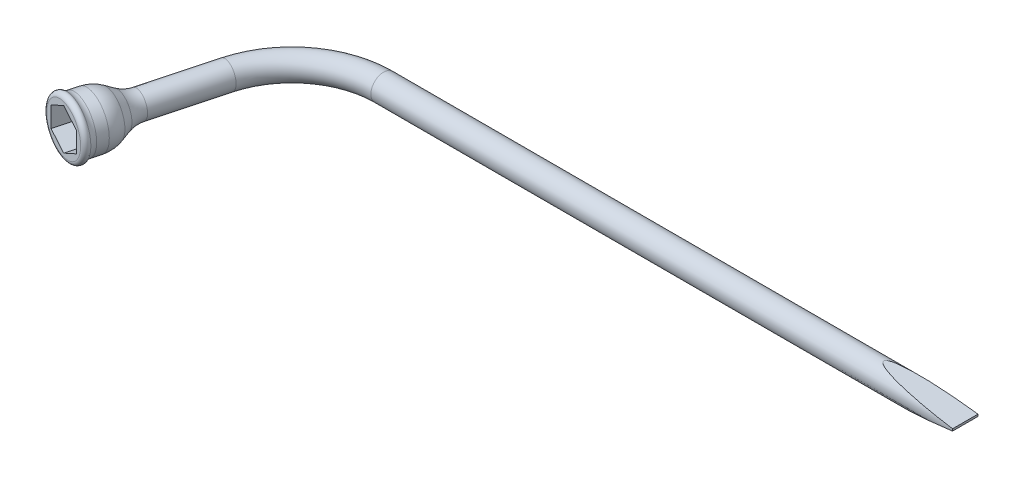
ISO-10303-21;
HEADER;
FILE_DESCRIPTION(('STEP AP214'),'2;1');
FILE_NAME('part.step','',(''),(''),'','','');
FILE_SCHEMA(('AUTOMOTIVE_DESIGN { 1 0 10303 214 1 1 1 1 }'));
ENDSEC;
DATA;
#1=APPLICATION_CONTEXT('core data for automotive mechanical design processes');
#2=APPLICATION_PROTOCOL_DEFINITION('international standard','automotive_design',2000,#1);
#3=PRODUCT_CONTEXT('',#1,'mechanical');
#4=PRODUCT('Part','Part','',(#3));
#5=PRODUCT_RELATED_PRODUCT_CATEGORY('part','',(#4));
#6=PRODUCT_DEFINITION_FORMATION('','',#4);
#7=PRODUCT_DEFINITION_CONTEXT('part definition',#1,'design');
#8=PRODUCT_DEFINITION('design','',#6,#7);
#9=PRODUCT_DEFINITION_SHAPE('','',#8);
#10=(LENGTH_UNIT() NAMED_UNIT(*) SI_UNIT(.MILLI.,.METRE.));
#11=(NAMED_UNIT(*) PLANE_ANGLE_UNIT() SI_UNIT($,.RADIAN.));
#12=(NAMED_UNIT(*) SI_UNIT($,.STERADIAN.) SOLID_ANGLE_UNIT());
#13=UNCERTAINTY_MEASURE_WITH_UNIT(LENGTH_MEASURE(1.E-05),#10,'distance_accuracy_value','');
#14=(GEOMETRIC_REPRESENTATION_CONTEXT(3) GLOBAL_UNCERTAINTY_ASSIGNED_CONTEXT((#13)) GLOBAL_UNIT_ASSIGNED_CONTEXT((#10,
#11,#12)) REPRESENTATION_CONTEXT('',''));
#15=CARTESIAN_POINT('',(0.,0.,0.));
#16=DIRECTION('',(0.,0.,1.));
#17=DIRECTION('',(1.,0.,0.));
#18=AXIS2_PLACEMENT_3D('',#15,#16,#17);
#19=CARTESIAN_POINT('',(43.8527373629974,0.,0.));
#20=DIRECTION('',(1.,0.,0.));
#21=DIRECTION('',(0.,0.,-1.));
#22=AXIS2_PLACEMENT_3D('',#19,#20,#21);
#23=CYLINDRICAL_SURFACE('',#22,7.9375);
#24=CARTESIAN_POINT('',(43.8527373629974,0.,0.));
#25=DIRECTION('',(1.,0.,0.));
#26=DIRECTION('',(0.,0.,-1.));
#27=AXIS2_PLACEMENT_3D('',#24,#25,#26);
#28=CIRCLE('',#27,7.9375);
#29=CARTESIAN_POINT('',(43.8527373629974,0.,-7.93749999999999));
#30=VERTEX_POINT('',#29);
#31=EDGE_CURVE('E107',#30,#30,#28,.T.);
#32=ORIENTED_EDGE('',*,*,#31,.T.);
#33=EDGE_LOOP('',(#32));
#34=FACE_BOUND('',#33,.T.);
#35=CARTESIAN_POINT('',(406.4,0.,0.));
#36=DIRECTION('',(1.,0.,0.));
#37=DIRECTION('',(0.,0.,-1.));
#38=AXIS2_PLACEMENT_3D('',#35,#36,#37);
#39=CIRCLE('',#38,7.9375);
#40=CARTESIAN_POINT('',(406.4,0.634999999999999,7.91205922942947));
#41=VERTEX_POINT('',#40);
#42=CARTESIAN_POINT('',(406.4,-0.635000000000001,7.9120592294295));
#43=VERTEX_POINT('',#42);
#44=EDGE_CURVE('E94',#41,#43,#39,.T.);
#45=ORIENTED_EDGE('',*,*,#44,.F.);
#46=CARTESIAN_POINT('',(410.817391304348,0.,0.));
#47=DIRECTION('',(0.1422873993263,0.98982538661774,0.));
#48=DIRECTION('',(0.98982538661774,-0.1422873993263,0.));
#49=AXIS2_PLACEMENT_3D('',#46,#47,#48);
#50=ELLIPSE('',#49,55.7849819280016,7.9375);
#51=CARTESIAN_POINT('',(406.4,0.634999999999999,-7.9120592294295));
#52=VERTEX_POINT('',#51);
#53=EDGE_CURVE('E99',#41,#52,#50,.F.);
#54=ORIENTED_EDGE('',*,*,#53,.T.);
#55=CARTESIAN_POINT('',(406.4,-0.635000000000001,-7.91205922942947));
#56=VERTEX_POINT('',#55);
#57=EDGE_CURVE('E44',#56,#52,#39,.T.);
#58=ORIENTED_EDGE('',*,*,#57,.F.);
#59=CARTESIAN_POINT('',(410.817391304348,0.,0.));
#60=DIRECTION('',(0.1422873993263,-0.98982538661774,0.));
#61=DIRECTION('',(0.98982538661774,0.1422873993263,0.));
#62=AXIS2_PLACEMENT_3D('',#59,#60,#61);
#63=ELLIPSE('',#62,55.7849819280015,7.9375);
#64=EDGE_CURVE('E93',#56,#43,#63,.F.);
#65=ORIENTED_EDGE('',*,*,#64,.T.);
#66=EDGE_LOOP('',(#45,#54,#58,#65));
#67=FACE_BOUND('',#66,.T.);
#68=ADVANCED_FACE('F28',(#34,#67),#23,.T.);
#69=CARTESIAN_POINT('',(406.4,0.,0.));
#70=DIRECTION('',(1.,0.,0.));
#71=DIRECTION('',(0.,0.,-1.));
#72=AXIS2_PLACEMENT_3D('',#69,#70,#71);
#73=PLANE('',#72);
#74=DIRECTION('',(0.,0.,-1.));
#75=VECTOR('',#74,1.);
#76=CARTESIAN_POINT('',(406.4,-0.635000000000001,0.));
#77=LINE('',#76,#75);
#78=EDGE_CURVE('E32',#43,#56,#77,.T.);
#79=ORIENTED_EDGE('',*,*,#78,.T.);
#80=ORIENTED_EDGE('',*,*,#57,.T.);
#81=DIRECTION('',(0.,0.,-1.));
#82=VECTOR('',#81,1.);
#83=CARTESIAN_POINT('',(406.4,0.634999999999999,700.152256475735));
#84=LINE('',#83,#82);
#85=EDGE_CURVE('E11',#41,#52,#84,.T.);
#86=ORIENTED_EDGE('',*,*,#85,.F.);
#87=ORIENTED_EDGE('',*,*,#44,.T.);
#88=EDGE_LOOP('',(#79,#80,#86,#87));
#89=FACE_BOUND('',#88,.T.);
#90=ADVANCED_FACE('F101',(#89),#73,.T.);
#91=CARTESIAN_POINT('',(-11.3499236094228,0.,42.3584915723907));
#92=DIRECTION('',(-0.258819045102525,0.,0.965925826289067));
#93=DIRECTION('',(0.965925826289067,0.,0.258819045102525));
#94=AXIS2_PLACEMENT_3D('',#91,#92,#93);
#95=CYLINDRICAL_SURFACE('',#94,7.9375);
#96=CARTESIAN_POINT('',(-23.0090131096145,0.,85.8708059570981));
#97=DIRECTION('',(0.258819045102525,0.,-0.965925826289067));
#98=DIRECTION('',(-0.965925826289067,0.,-0.258819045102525));
#99=AXIS2_PLACEMENT_3D('',#96,#97,#98);
#100=CIRCLE('',#99,7.9375);
#101=CARTESIAN_POINT('',(-30.6760493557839,0.,83.8164297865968));
#102=VERTEX_POINT('',#101);
#103=EDGE_CURVE('E130',#102,#102,#100,.T.);
#104=ORIENTED_EDGE('',*,*,#103,.T.);
#105=EDGE_LOOP('',(#104));
#106=FACE_BOUND('',#105,.T.);
#107=CARTESIAN_POINT('',(-11.3499236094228,0.,42.3584915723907));
#108=DIRECTION('',(0.258819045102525,0.,-0.965925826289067));
#109=DIRECTION('',(-0.965925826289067,0.,-0.258819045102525));
#110=AXIS2_PLACEMENT_3D('',#107,#108,#109);
#111=CIRCLE('',#110,7.9375);
#112=CARTESIAN_POINT('',(-19.0169598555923,0.,40.3041154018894));
#113=VERTEX_POINT('',#112);
#114=EDGE_CURVE('E105',#113,#113,#111,.T.);
#115=ORIENTED_EDGE('',*,*,#114,.F.);
#116=EDGE_LOOP('',(#115));
#117=FACE_BOUND('',#116,.T.);
#118=ADVANCED_FACE('F30',(#106,#117),#95,.T.);
#119=CARTESIAN_POINT('',(43.8527373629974,0.,57.15));
#120=DIRECTION('',(0.,1.,0.));
#121=DIRECTION('',(0.,0.,1.));
#122=AXIS2_PLACEMENT_3D('',#119,#120,#121);
#123=TOROIDAL_SURFACE('',#122,57.15,7.9375);
#124=CARTESIAN_POINT('',(43.8527373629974,0.,57.15));
#125=DIRECTION('',(0.,1.,0.));
#126=DIRECTION('',(0.,0.,1.));
#127=AXIS2_PLACEMENT_3D('',#124,#125,#126);
#128=CIRCLE('',#127,65.0875);
#129=EDGE_CURVE('',#30,#113,#128,.T.);
#130=ORIENTED_EDGE('',*,*,#31,.F.);
#131=ORIENTED_EDGE('',*,*,#114,.T.);
#132=ORIENTED_EDGE('',*,*,#129,.T.);
#133=ORIENTED_EDGE('',*,*,#129,.F.);
#134=EDGE_LOOP('',(#130,#132,#131,#133));
#135=FACE_BOUND('',#134,.T.);
#136=ADVANCED_FACE('F246',(#135),#123,.T.);
#137=CARTESIAN_POINT('',(-32.2126183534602,0.,120.219128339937));
#138=DIRECTION('',(0.258819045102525,0.,-0.965925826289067));
#139=DIRECTION('',(-0.965925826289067,0.,-0.258819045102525));
#140=AXIS2_PLACEMENT_3D('',#137,#138,#139);
#141=TOROIDAL_SURFACE('',#140,14.9225,2.54);
#142=CARTESIAN_POINT('',(-32.8700187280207,0.,122.672579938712));
#143=DIRECTION('',(0.258819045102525,0.,-0.965925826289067));
#144=DIRECTION('',(-0.965925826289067,0.,-0.258819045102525));
#145=AXIS2_PLACEMENT_3D('',#142,#143,#144);
#146=CIRCLE('',#145,14.9225);
#147=CARTESIAN_POINT('',(-47.2840468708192,0.,118.810352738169));
#148=VERTEX_POINT('',#147);
#149=EDGE_CURVE('E102',#148,#148,#146,.T.);
#150=ORIENTED_EDGE('',*,*,#149,.T.);
#151=EDGE_LOOP('',(#150));
#152=FACE_BOUND('',#151,.T.);
#153=CARTESIAN_POINT('',(-31.8376954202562,0.,118.819896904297));
#154=DIRECTION('',(0.258819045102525,0.,-0.965925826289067));
#155=DIRECTION('',(-0.965925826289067,0.,-0.258819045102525));
#156=AXIS2_PLACEMENT_3D('',#153,#154,#155);
#157=CIRCLE('',#156,17.0089285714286);
#158=CARTESIAN_POINT('',(-48.267058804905,0.,114.417662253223));
#159=VERTEX_POINT('',#158);
#160=EDGE_CURVE('E115',#159,#159,#157,.T.);
#161=ORIENTED_EDGE('',*,*,#160,.F.);
#162=EDGE_LOOP('',(#161));
#163=FACE_BOUND('',#162,.T.);
#164=ADVANCED_FACE('F248',(#152,#163),#141,.T.);
#165=CARTESIAN_POINT('',(-30.900388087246,0.,115.321818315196));
#166=DIRECTION('',(0.258819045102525,0.,-0.965925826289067));
#167=DIRECTION('',(-0.965925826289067,0.,-0.258819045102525));
#168=AXIS2_PLACEMENT_3D('',#165,#166,#167);
#169=TOROIDAL_SURFACE('',#168,22.225,6.35000000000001);
#170=ORIENTED_EDGE('',*,*,#160,.T.);
#171=EDGE_LOOP('',(#170));
#172=FACE_BOUND('',#171,.T.);
#173=CARTESIAN_POINT('',(-30.900388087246,0.,115.321818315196));
#174=DIRECTION('',(0.258819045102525,0.,-0.965925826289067));
#175=DIRECTION('',(-0.965925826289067,0.,-0.258819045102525));
#176=AXIS2_PLACEMENT_3D('',#173,#174,#175);
#177=CIRCLE('',#176,15.875);
#178=CARTESIAN_POINT('',(-46.2344605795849,0.,111.213065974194));
#179=VERTEX_POINT('',#178);
#180=EDGE_CURVE('E118',#179,#179,#177,.T.);
#181=ORIENTED_EDGE('',*,*,#180,.F.);
#182=EDGE_LOOP('',(#181));
#183=FACE_BOUND('',#182,.T.);
#184=ADVANCED_FACE('F254',(#172,#183),#169,.F.);
#185=CARTESIAN_POINT('',(-15.1267657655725,0.,56.4538583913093));
#186=DIRECTION('',(0.258819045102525,0.,-0.965925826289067));
#187=DIRECTION('',(-0.965925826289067,0.,-0.258819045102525));
#188=AXIS2_PLACEMENT_3D('',#185,#186,#187);
#189=CYLINDRICAL_SURFACE('',#188,15.875);
#190=CARTESIAN_POINT('',(-29.2370166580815,0.,109.114031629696));
#191=DIRECTION('',(0.258819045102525,0.,-0.965925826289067));
#192=DIRECTION('',(-0.965925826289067,0.,-0.258819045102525));
#193=AXIS2_PLACEMENT_3D('',#190,#191,#192);
#194=CIRCLE('',#193,15.875);
#195=CARTESIAN_POINT('',(-44.5710891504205,0.,105.005279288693));
#196=VERTEX_POINT('',#195);
#197=EDGE_CURVE('E121',#196,#196,#194,.T.);
#198=CARTESIAN_POINT('',(-46.2344605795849,0.,111.213065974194));
#199=CARTESIAN_POINT('',(-46.2171337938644,0.,111.148401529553));
#200=CARTESIAN_POINT('',(-46.199807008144,0.,111.083737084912));
#201=CARTESIAN_POINT('',(-46.165153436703,0.,110.954408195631));
#202=CARTESIAN_POINT('',(-46.1478266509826,0.,110.88974375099));
#203=CARTESIAN_POINT('',(-46.1131730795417,0.,110.760414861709));
#204=CARTESIAN_POINT('',(-46.0958462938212,0.,110.695750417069));
#205=CARTESIAN_POINT('',(-46.0611927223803,0.,110.566421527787));
#206=CARTESIAN_POINT('',(-46.0438659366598,0.,110.501757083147));
#207=CARTESIAN_POINT('',(-46.0092123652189,0.,110.372428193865));
#208=CARTESIAN_POINT('',(-45.9918855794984,0.,110.307763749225));
#209=CARTESIAN_POINT('',(-45.9572320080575,0.,110.178434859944));
#210=CARTESIAN_POINT('',(-45.939905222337,0.,110.113770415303));
#211=CARTESIAN_POINT('',(-45.9052516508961,0.,109.984441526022));
#212=CARTESIAN_POINT('',(-45.8879248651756,0.,109.919777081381));
#213=CARTESIAN_POINT('',(-45.8532712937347,0.,109.7904481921));
#214=CARTESIAN_POINT('',(-45.8359445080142,0.,109.725783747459));
#215=CARTESIAN_POINT('',(-45.8012909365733,0.,109.596454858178));
#216=CARTESIAN_POINT('',(-45.7839641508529,0.,109.531790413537));
#217=CARTESIAN_POINT('',(-45.7493105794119,0.,109.402461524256));
#218=CARTESIAN_POINT('',(-45.7319837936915,0.,109.337797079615));
#219=CARTESIAN_POINT('',(-45.6973302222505,0.,109.208468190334));
#220=CARTESIAN_POINT('',(-45.6800034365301,0.,109.143803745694));
#221=CARTESIAN_POINT('',(-45.6453498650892,0.,109.014474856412));
#222=CARTESIAN_POINT('',(-45.6280230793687,0.,108.949810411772));
#223=CARTESIAN_POINT('',(-45.5933695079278,0.,108.82048152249));
#224=CARTESIAN_POINT('',(-45.5760427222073,0.,108.75581707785));
#225=CARTESIAN_POINT('',(-45.5413891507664,0.,108.626488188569));
#226=CARTESIAN_POINT('',(-45.5240623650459,0.,108.561823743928));
#227=CARTESIAN_POINT('',(-45.489408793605,0.,108.432494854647));
#228=CARTESIAN_POINT('',(-45.4720820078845,0.,108.367830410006));
#229=CARTESIAN_POINT('',(-45.4374284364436,0.,108.238501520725));
#230=CARTESIAN_POINT('',(-45.4201016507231,0.,108.173837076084));
#231=CARTESIAN_POINT('',(-45.3854480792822,0.,108.044508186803));
#232=CARTESIAN_POINT('',(-45.3681212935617,0.,107.979843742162));
#233=CARTESIAN_POINT('',(-45.3334677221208,0.,107.850514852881));
#234=CARTESIAN_POINT('',(-45.3161409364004,0.,107.78585040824));
#235=CARTESIAN_POINT('',(-45.2814873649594,0.,107.656521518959));
#236=CARTESIAN_POINT('',(-45.264160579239,0.,107.591857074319));
#237=CARTESIAN_POINT('',(-45.229507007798,0.,107.462528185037));
#238=CARTESIAN_POINT('',(-45.2121802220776,0.,107.397863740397));
#239=CARTESIAN_POINT('',(-45.1775266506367,0.,107.268534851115));
#240=CARTESIAN_POINT('',(-45.1601998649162,0.,107.203870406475));
#241=CARTESIAN_POINT('',(-45.1255462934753,0.,107.074541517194));
#242=CARTESIAN_POINT('',(-45.1082195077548,0.,107.009877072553));
#243=CARTESIAN_POINT('',(-45.0735659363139,0.,106.880548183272));
#244=CARTESIAN_POINT('',(-45.0562391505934,0.,106.815883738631));
#245=CARTESIAN_POINT('',(-45.0215855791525,0.,106.68655484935));
#246=CARTESIAN_POINT('',(-45.004258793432,0.,106.621890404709));
#247=CARTESIAN_POINT('',(-44.9696052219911,0.,106.492561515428));
#248=CARTESIAN_POINT('',(-44.9522784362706,0.,106.427897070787));
#249=CARTESIAN_POINT('',(-44.9176248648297,0.,106.298568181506));
#250=CARTESIAN_POINT('',(-44.9002980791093,0.,106.233903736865));
#251=CARTESIAN_POINT('',(-44.8656445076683,0.,106.104574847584));
#252=CARTESIAN_POINT('',(-44.8483177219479,0.,106.039910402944));
#253=CARTESIAN_POINT('',(-44.8136641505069,0.,105.910581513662));
#254=CARTESIAN_POINT('',(-44.7963373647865,0.,105.845917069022));
#255=CARTESIAN_POINT('',(-44.7616837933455,0.,105.71658817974));
#256=CARTESIAN_POINT('',(-44.7443570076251,0.,105.6519237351));
#257=CARTESIAN_POINT('',(-44.7097034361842,0.,105.522594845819));
#258=CARTESIAN_POINT('',(-44.6923766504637,0.,105.457930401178));
#259=CARTESIAN_POINT('',(-44.6577230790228,0.,105.328601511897));
#260=CARTESIAN_POINT('',(-44.6403962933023,0.,105.263937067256));
#261=CARTESIAN_POINT('',(-44.6057427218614,0.,105.134608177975));
#262=CARTESIAN_POINT('',(-44.5884159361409,0.,105.069943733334));
#263=CARTESIAN_POINT('',(-44.5710891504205,0.,105.005279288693));
#264=B_SPLINE_CURVE_WITH_KNOTS('',3,(#198,#199,#200,#201,#202,#203,#204,#205,#206,#207,#208,
#209,#210,#211,#212,#213,#214,#215,#216,#217,#218,#219,#220,#221,#222,#223,#224,#225,#226,#227,
#228,#229,#230,#231,#232,#233,#234,#235,#236,#237,#238,#239,#240,#241,#242,#243,#244,#245,#246,
#247,#248,#249,#250,#251,#252,#253,#254,#255,#256,#257,#258,#259,#260,#261,#262,#263),
.UNSPECIFIED.,.F.,.F.,(4,2,2,2,2,2,2,2,2,2,2,2,2,2,2,2,2,2,2,2,2,2,2,2,2,2,2,2,2,2,2,2,4),(0.,
0.20083667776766,0.401673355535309,0.60251003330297,0.803346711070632,1.00418338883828,
1.20502006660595,1.4058567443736,1.60669342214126,1.80753009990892,2.00836677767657,
2.20920345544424,2.4100401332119,2.61087681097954,2.8117134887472,3.01255016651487,
3.21338684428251,3.41422352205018,3.61506019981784,3.81589687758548,4.01673355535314,
4.21757023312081,4.41840691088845,4.61924358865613,4.82008026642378,5.02091694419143,
5.2217536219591,5.42259029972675,5.62342697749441,5.82426365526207,6.02510033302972,
6.22593701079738,6.42677368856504),.UNSPECIFIED.);
#265=EDGE_CURVE('BSEAM283',#179,#196,#264,.T.);
#266=ORIENTED_EDGE('',*,*,#180,.T.);
#267=ORIENTED_EDGE('',*,*,#197,.F.);
#268=ORIENTED_EDGE('',*,*,#265,.T.);
#269=ORIENTED_EDGE('',*,*,#265,.F.);
#270=EDGE_LOOP('',(#266,#268,#267,#269));
#271=FACE_BOUND('',#270,.T.);
#272=ADVANCED_FACE('F283',(#271),#189,.T.);
#273=CARTESIAN_POINT('',(-29.2370166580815,0.,109.114031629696));
#274=DIRECTION('',(0.258819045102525,0.,-0.965925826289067));
#275=DIRECTION('',(-0.965925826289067,0.,-0.258819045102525));
#276=AXIS2_PLACEMENT_3D('',#273,#274,#275);
#277=DEGENERATE_TOROIDAL_SURFACE('',#276,3.17500000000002,19.05,.F.);
#278=ORIENTED_EDGE('',*,*,#197,.T.);
#279=EDGE_LOOP('',(#278));
#280=FACE_BOUND('',#279,.T.);
#281=CARTESIAN_POINT('',(-26.8100852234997,0.,100.056600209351));
#282=DIRECTION('',(0.258819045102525,0.,-0.965925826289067));
#283=DIRECTION('',(-0.965925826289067,0.,-0.258819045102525));
#284=AXIS2_PLACEMENT_3D('',#281,#282,#283);
#285=CIRCLE('',#284,13.4073834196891);
#286=CARTESIAN_POINT('',(-13.8595473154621,0.,103.526686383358));
#287=VERTEX_POINT('',#286);
#288=EDGE_CURVE('E124',#287,#287,#285,.T.);
#289=ORIENTED_EDGE('',*,*,#288,.F.);
#290=EDGE_LOOP('',(#289));
#291=FACE_BOUND('',#290,.T.);
#292=ADVANCED_FACE('F275',(#280,#291),#277,.F.);
#293=CARTESIAN_POINT('',(-25.4359445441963,0.,94.9282373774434));
#294=DIRECTION('',(-0.258819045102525,0.,0.965925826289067));
#295=DIRECTION('',(0.965925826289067,0.,0.258819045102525));
#296=AXIS2_PLACEMENT_3D('',#293,#294,#295);
#297=CONICAL_SURFACE('',#296,10.4051165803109,0.51464742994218);
#298=CARTESIAN_POINT('',(-25.4359445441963,0.,94.9282373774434));
#299=DIRECTION('',(0.258819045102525,0.,-0.965925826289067));
#300=DIRECTION('',(-0.965925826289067,0.,-0.258819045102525));
#301=AXIS2_PLACEMENT_3D('',#298,#299,#300);
#302=CIRCLE('',#301,10.4051165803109);
#303=CARTESIAN_POINT('',(-15.3853737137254,0.,97.6212797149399));
#304=VERTEX_POINT('',#303);
#305=EDGE_CURVE('E127',#304,#304,#302,.T.);
#306=CARTESIAN_POINT('',(-13.8595473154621,0.,103.526686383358));
#307=CARTESIAN_POINT('',(-13.875441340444,0.,103.465171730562));
#308=CARTESIAN_POINT('',(-13.8913353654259,0.,103.403657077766));
#309=CARTESIAN_POINT('',(-13.9231234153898,0.,103.280627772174));
#310=CARTESIAN_POINT('',(-13.9390174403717,0.,103.219113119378));
#311=CARTESIAN_POINT('',(-13.9708054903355,0.,103.096083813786));
#312=CARTESIAN_POINT('',(-13.9866995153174,0.,103.03456916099));
#313=CARTESIAN_POINT('',(-14.0184875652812,0.,102.911539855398));
#314=CARTESIAN_POINT('',(-14.0343815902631,0.,102.850025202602));
#315=CARTESIAN_POINT('',(-14.0661696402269,0.,102.72699589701));
#316=CARTESIAN_POINT('',(-14.0820636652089,0.,102.665481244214));
#317=CARTESIAN_POINT('',(-14.1138517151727,0.,102.542451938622));
#318=CARTESIAN_POINT('',(-14.1297457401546,0.,102.480937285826));
#319=CARTESIAN_POINT('',(-14.1615337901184,0.,102.357907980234));
#320=CARTESIAN_POINT('',(-14.1774278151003,0.,102.296393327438));
#321=CARTESIAN_POINT('',(-14.2092158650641,0.,102.173364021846));
#322=CARTESIAN_POINT('',(-14.225109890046,0.,102.11184936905));
#323=CARTESIAN_POINT('',(-14.2568979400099,0.,101.988820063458));
#324=CARTESIAN_POINT('',(-14.2727919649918,0.,101.927305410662));
#325=CARTESIAN_POINT('',(-14.3045800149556,0.,101.804276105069));
#326=CARTESIAN_POINT('',(-14.3204740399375,0.,101.742761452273));
#327=CARTESIAN_POINT('',(-14.3522620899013,0.,101.619732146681));
#328=CARTESIAN_POINT('',(-14.3681561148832,0.,101.558217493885));
#329=CARTESIAN_POINT('',(-14.399944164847,0.,101.435188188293));
#330=CARTESIAN_POINT('',(-14.415838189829,0.,101.373673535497));
#331=CARTESIAN_POINT('',(-14.4476262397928,0.,101.250644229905));
#332=CARTESIAN_POINT('',(-14.4635202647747,0.,101.189129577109));
#333=CARTESIAN_POINT('',(-14.4953083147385,0.,101.066100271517));
#334=CARTESIAN_POINT('',(-14.5112023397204,0.,101.004585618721));
#335=CARTESIAN_POINT('',(-14.5429903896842,0.,100.881556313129));
#336=CARTESIAN_POINT('',(-14.5588844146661,0.,100.820041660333));
#337=CARTESIAN_POINT('',(-14.59067246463,0.,100.697012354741));
#338=CARTESIAN_POINT('',(-14.6065664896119,0.,100.635497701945));
#339=CARTESIAN_POINT('',(-14.6383545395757,0.,100.512468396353));
#340=CARTESIAN_POINT('',(-14.6542485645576,0.,100.450953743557));
#341=CARTESIAN_POINT('',(-14.6860366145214,0.,100.327924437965));
#342=CARTESIAN_POINT('',(-14.7019306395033,0.,100.266409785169));
#343=CARTESIAN_POINT('',(-14.7337186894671,0.,100.143380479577));
#344=CARTESIAN_POINT('',(-14.7496127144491,0.,100.081865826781));
#345=CARTESIAN_POINT('',(-14.7814007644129,0.,99.9588365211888));
#346=CARTESIAN_POINT('',(-14.7972947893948,0.,99.8973218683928));
#347=CARTESIAN_POINT('',(-14.8290828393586,0.,99.7742925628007));
#348=CARTESIAN_POINT('',(-14.8449768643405,0.,99.7127779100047));
#349=CARTESIAN_POINT('',(-14.8767649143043,0.,99.5897486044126));
#350=CARTESIAN_POINT('',(-14.8926589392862,0.,99.5282339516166));
#351=CARTESIAN_POINT('',(-14.9244469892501,0.,99.4052046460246));
#352=CARTESIAN_POINT('',(-14.940341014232,0.,99.3436899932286));
#353=CARTESIAN_POINT('',(-14.9721290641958,0.,99.2206606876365));
#354=CARTESIAN_POINT('',(-14.9880230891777,0.,99.1591460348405));
#355=CARTESIAN_POINT('',(-15.0198111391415,0.,99.0361167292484));
#356=CARTESIAN_POINT('',(-15.0357051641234,0.,98.9746020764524));
#357=CARTESIAN_POINT('',(-15.0674932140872,0.,98.8515727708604));
#358=CARTESIAN_POINT('',(-15.0833872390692,0.,98.7900581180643));
#359=CARTESIAN_POINT('',(-15.115175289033,0.,98.6670288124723));
#360=CARTESIAN_POINT('',(-15.1310693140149,0.,98.6055141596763));
#361=CARTESIAN_POINT('',(-15.1628573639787,0.,98.4824848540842));
#362=CARTESIAN_POINT('',(-15.1787513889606,0.,98.4209702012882));
#363=CARTESIAN_POINT('',(-15.2105394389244,0.,98.2979408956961));
#364=CARTESIAN_POINT('',(-15.2264334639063,0.,98.2364262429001));
#365=CARTESIAN_POINT('',(-15.2582215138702,0.,98.1133969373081));
#366=CARTESIAN_POINT('',(-15.2741155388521,0.,98.051882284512));
#367=CARTESIAN_POINT('',(-15.3059035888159,0.,97.92885297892));
#368=CARTESIAN_POINT('',(-15.3217976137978,0.,97.867338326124));
#369=CARTESIAN_POINT('',(-15.3535856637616,0.,97.7443090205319));
#370=CARTESIAN_POINT('',(-15.3694796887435,0.,97.6827943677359));
#371=CARTESIAN_POINT('',(-15.3853737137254,0.,97.6212797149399));
#372=B_SPLINE_CURVE_WITH_KNOTS('',3,(#306,#307,#308,#309,#310,#311,#312,#313,#314,#315,#316,
#317,#318,#319,#320,#321,#322,#323,#324,#325,#326,#327,#328,#329,#330,#331,#332,#333,#334,#335,
#336,#337,#338,#339,#340,#341,#342,#343,#344,#345,#346,#347,#348,#349,#350,#351,#352,#353,#354,
#355,#356,#357,#358,#359,#360,#361,#362,#363,#364,#365,#366,#367,#368,#369,#370,#371),
.UNSPECIFIED.,.F.,.F.,(4,2,2,2,2,2,2,2,2,2,2,2,2,2,2,2,2,2,2,2,2,2,2,2,2,2,2,2,2,2,2,2,4),(0.,
0.190604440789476,0.381208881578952,0.571813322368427,0.762417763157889,0.953022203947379,
1.14362664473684,1.33423108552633,1.52483552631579,1.71543996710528,1.90604440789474,
2.09664884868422,2.28725328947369,2.47785773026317,2.66846217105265,2.85906661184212,
3.0496710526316,3.24027549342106,3.43087993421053,3.62148437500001,3.81208881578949,
4.00269325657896,4.19329769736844,4.3839021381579,4.57450657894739,4.76511101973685,
4.95571546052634,5.1463199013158,5.33692434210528,5.52752878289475,5.71813322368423,
5.90873766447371,6.09934210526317),.UNSPECIFIED.);
#373=EDGE_CURVE('BSEAM266',#287,#304,#372,.T.);
#374=ORIENTED_EDGE('',*,*,#288,.T.);
#375=ORIENTED_EDGE('',*,*,#305,.F.);
#376=ORIENTED_EDGE('',*,*,#373,.T.);
#377=ORIENTED_EDGE('',*,*,#373,.F.);
#378=EDGE_LOOP('',(#374,#376,#375,#377));
#379=FACE_BOUND('',#378,.T.);
#380=ADVANCED_FACE('F266',(#379),#297,.T.);
#381=CARTESIAN_POINT('',(-23.0090131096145,0.,85.8708059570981));
#382=DIRECTION('',(0.258819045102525,0.,-0.965925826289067));
#383=DIRECTION('',(-0.965925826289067,0.,-0.258819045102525));
#384=AXIS2_PLACEMENT_3D('',#381,#382,#383);
#385=TOROIDAL_SURFACE('',#384,26.9875,19.05);
#386=ORIENTED_EDGE('',*,*,#305,.T.);
#387=EDGE_LOOP('',(#386));
#388=FACE_BOUND('',#387,.T.);
#389=ORIENTED_EDGE('',*,*,#103,.F.);
#390=EDGE_LOOP('',(#389));
#391=FACE_BOUND('',#390,.T.);
#392=ADVANCED_FACE('F264',(#388,#391),#385,.F.);
#393=CARTESIAN_POINT('',(-32.8700187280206,0.,122.672579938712));
#394=DIRECTION('',(0.258819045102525,0.,-0.965925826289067));
#395=DIRECTION('',(-0.965925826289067,0.,-0.258819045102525));
#396=AXIS2_PLACEMENT_3D('',#393,#394,#395);
#397=PLANE('',#396);
#398=DIRECTION('',(0.,1.,0.));
#399=VECTOR('',#398,1.);
#400=CARTESIAN_POINT('',(-22.1361679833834,-6.41580486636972,125.548706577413));
#401=LINE('',#400,#399);
#402=CARTESIAN_POINT('',(-22.1361679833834,-6.41580486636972,125.548706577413));
#403=VERTEX_POINT('',#402);
#404=CARTESIAN_POINT('',(-22.1361679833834,6.41580486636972,125.548706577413));
#405=VERTEX_POINT('',#404);
#406=EDGE_CURVE('E175',#403,#405,#401,.T.);
#407=ORIENTED_EDGE('',*,*,#406,.F.);
#408=DIRECTION('',(0.836516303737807,0.5,0.224143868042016));
#409=VECTOR('',#408,1.);
#410=CARTESIAN_POINT('',(-32.8700187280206,-12.8316097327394,122.672579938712));
#411=LINE('',#410,#409);
#412=CARTESIAN_POINT('',(-32.8700187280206,-12.8316097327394,122.672579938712));
#413=VERTEX_POINT('',#412);
#414=EDGE_CURVE('E178',#413,#403,#411,.T.);
#415=ORIENTED_EDGE('',*,*,#414,.F.);
#416=DIRECTION('',(0.836516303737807,-0.5,0.224143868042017));
#417=VECTOR('',#416,1.);
#418=CARTESIAN_POINT('',(-43.6038694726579,-6.41580486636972,119.79645330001));
#419=LINE('',#418,#417);
#420=CARTESIAN_POINT('',(-43.6038694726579,-6.41580486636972,119.79645330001));
#421=VERTEX_POINT('',#420);
#422=EDGE_CURVE('E163',#421,#413,#419,.T.);
#423=ORIENTED_EDGE('',*,*,#422,.F.);
#424=DIRECTION('',(0.,-1.,0.));
#425=VECTOR('',#424,1.);
#426=CARTESIAN_POINT('',(-43.6038694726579,6.41580486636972,119.79645330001));
#427=LINE('',#426,#425);
#428=CARTESIAN_POINT('',(-43.6038694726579,6.41580486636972,119.79645330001));
#429=VERTEX_POINT('',#428);
#430=EDGE_CURVE('E166',#429,#421,#427,.T.);
#431=ORIENTED_EDGE('',*,*,#430,.F.);
#432=DIRECTION('',(-0.836516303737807,-0.5,-0.224143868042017));
#433=VECTOR('',#432,1.);
#434=CARTESIAN_POINT('',(-32.8700187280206,12.8316097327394,122.672579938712));
#435=LINE('',#434,#433);
#436=CARTESIAN_POINT('',(-32.8700187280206,12.8316097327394,122.672579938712));
#437=VERTEX_POINT('',#436);
#438=EDGE_CURVE('E169',#437,#429,#435,.T.);
#439=ORIENTED_EDGE('',*,*,#438,.F.);
#440=DIRECTION('',(-0.836516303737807,0.5,-0.224143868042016));
#441=VECTOR('',#440,1.);
#442=CARTESIAN_POINT('',(-22.1361679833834,6.41580486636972,125.548706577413));
#443=LINE('',#442,#441);
#444=EDGE_CURVE('E172',#405,#437,#443,.T.);
#445=ORIENTED_EDGE('',*,*,#444,.F.);
#446=EDGE_LOOP('',(#407,#415,#423,#431,#439,#445));
#447=FACE_BOUND('',#446,.T.);
#448=ORIENTED_EDGE('',*,*,#149,.F.);
#449=EDGE_LOOP('',(#448));
#450=FACE_BOUND('',#449,.T.);
#451=ADVANCED_FACE('F245',(#447,#450),#397,.F.);
#452=CARTESIAN_POINT('',(-29.5830168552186,-12.8316097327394,110.40532194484));
#453=DIRECTION('',(0.482962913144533,-0.866025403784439,0.129409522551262));
#454=DIRECTION('',(0.873369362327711,0.487058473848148,0.));
#455=AXIS2_PLACEMENT_3D('',#452,#453,#454);
#456=PLANE('',#455);
#457=ORIENTED_EDGE('',*,*,#414,.T.);
#458=DIRECTION('',(-0.258819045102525,0.,0.965925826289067));
#459=VECTOR('',#458,1.);
#460=CARTESIAN_POINT('',(-18.8491661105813,-6.41580486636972,113.281448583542));
#461=LINE('',#460,#459);
#462=CARTESIAN_POINT('',(-18.8491661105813,-6.41580486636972,113.281448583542));
#463=VERTEX_POINT('',#462);
#464=EDGE_CURVE('E134',#463,#403,#461,.T.);
#465=ORIENTED_EDGE('',*,*,#464,.F.);
#466=DIRECTION('',(0.836516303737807,0.5,0.224143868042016));
#467=VECTOR('',#466,1.);
#468=CARTESIAN_POINT('',(-29.5830168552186,-12.8316097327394,110.40532194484));
#469=LINE('',#468,#467);
#470=CARTESIAN_POINT('',(-29.5830168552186,-12.8316097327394,110.40532194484));
#471=VERTEX_POINT('',#470);
#472=EDGE_CURVE('E160',#471,#463,#469,.T.);
#473=ORIENTED_EDGE('',*,*,#472,.F.);
#474=DIRECTION('',(-0.258819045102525,0.,0.965925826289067));
#475=VECTOR('',#474,1.);
#476=CARTESIAN_POINT('',(-29.5830168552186,-12.8316097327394,110.40532194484));
#477=LINE('',#476,#475);
#478=EDGE_CURVE('E133',#471,#413,#477,.T.);
#479=ORIENTED_EDGE('',*,*,#478,.T.);
#480=EDGE_LOOP('',(#457,#465,#473,#479));
#481=FACE_BOUND('',#480,.T.);
#482=ADVANCED_FACE('F273',(#481),#456,.F.);
#483=CARTESIAN_POINT('',(-40.3168675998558,-6.41580486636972,107.529195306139));
#484=DIRECTION('',(-0.482962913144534,-0.866025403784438,-0.129409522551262));
#485=DIRECTION('',(0.873369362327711,-0.487058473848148,0.));
#486=AXIS2_PLACEMENT_3D('',#483,#484,#485);
#487=PLANE('',#486);
#488=ORIENTED_EDGE('',*,*,#422,.T.);
#489=ORIENTED_EDGE('',*,*,#478,.F.);
#490=DIRECTION('',(0.836516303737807,-0.5,0.224143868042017));
#491=VECTOR('',#490,1.);
#492=CARTESIAN_POINT('',(-40.3168675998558,-6.41580486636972,107.529195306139));
#493=LINE('',#492,#491);
#494=CARTESIAN_POINT('',(-40.3168675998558,-6.41580486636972,107.529195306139));
#495=VERTEX_POINT('',#494);
#496=EDGE_CURVE('E138',#495,#471,#493,.T.);
#497=ORIENTED_EDGE('',*,*,#496,.F.);
#498=DIRECTION('',(-0.258819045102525,0.,0.965925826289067));
#499=VECTOR('',#498,1.);
#500=CARTESIAN_POINT('',(-40.3168675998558,-6.41580486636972,107.529195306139));
#501=LINE('',#500,#499);
#502=EDGE_CURVE('E144',#495,#421,#501,.T.);
#503=ORIENTED_EDGE('',*,*,#502,.T.);
#504=EDGE_LOOP('',(#488,#489,#497,#503));
#505=FACE_BOUND('',#504,.T.);
#506=ADVANCED_FACE('F332',(#505),#487,.F.);
#507=CARTESIAN_POINT('',(-40.3168675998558,6.41580486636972,107.529195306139));
#508=DIRECTION('',(-0.965925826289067,0.,-0.258819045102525));
#509=DIRECTION('',(-0.258819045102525,0.,0.965925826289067));
#510=AXIS2_PLACEMENT_3D('',#507,#508,#509);
#511=PLANE('',#510);
#512=ORIENTED_EDGE('',*,*,#430,.T.);
#513=ORIENTED_EDGE('',*,*,#502,.F.);
#514=DIRECTION('',(0.,-1.,0.));
#515=VECTOR('',#514,1.);
#516=CARTESIAN_POINT('',(-40.3168675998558,6.41580486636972,107.529195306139));
#517=LINE('',#516,#515);
#518=CARTESIAN_POINT('',(-40.3168675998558,6.41580486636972,107.529195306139));
#519=VERTEX_POINT('',#518);
#520=EDGE_CURVE('E149',#519,#495,#517,.T.);
#521=ORIENTED_EDGE('',*,*,#520,.F.);
#522=DIRECTION('',(-0.258819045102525,0.,0.965925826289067));
#523=VECTOR('',#522,1.);
#524=CARTESIAN_POINT('',(-40.3168675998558,6.41580486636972,107.529195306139));
#525=LINE('',#524,#523);
#526=EDGE_CURVE('E142',#519,#429,#525,.T.);
#527=ORIENTED_EDGE('',*,*,#526,.T.);
#528=EDGE_LOOP('',(#512,#513,#521,#527));
#529=FACE_BOUND('',#528,.T.);
#530=ADVANCED_FACE('F339',(#529),#511,.F.);
#531=CARTESIAN_POINT('',(-29.5830168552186,12.8316097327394,110.40532194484));
#532=DIRECTION('',(-0.482962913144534,0.866025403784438,-0.129409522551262));
#533=DIRECTION('',(-0.873369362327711,-0.487058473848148,0.));
#534=AXIS2_PLACEMENT_3D('',#531,#532,#533);
#535=PLANE('',#534);
#536=ORIENTED_EDGE('',*,*,#438,.T.);
#537=ORIENTED_EDGE('',*,*,#526,.F.);
#538=DIRECTION('',(-0.836516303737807,-0.5,-0.224143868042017));
#539=VECTOR('',#538,1.);
#540=CARTESIAN_POINT('',(-29.5830168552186,12.8316097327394,110.40532194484));
#541=LINE('',#540,#539);
#542=CARTESIAN_POINT('',(-29.5830168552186,12.8316097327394,110.40532194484));
#543=VERTEX_POINT('',#542);
#544=EDGE_CURVE('E151',#543,#519,#541,.T.);
#545=ORIENTED_EDGE('',*,*,#544,.F.);
#546=DIRECTION('',(-0.258819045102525,0.,0.965925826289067));
#547=VECTOR('',#546,1.);
#548=CARTESIAN_POINT('',(-29.5830168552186,12.8316097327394,110.40532194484));
#549=LINE('',#548,#547);
#550=EDGE_CURVE('E140',#543,#437,#549,.T.);
#551=ORIENTED_EDGE('',*,*,#550,.T.);
#552=EDGE_LOOP('',(#536,#537,#545,#551));
#553=FACE_BOUND('',#552,.T.);
#554=ADVANCED_FACE('F347',(#553),#535,.F.);
#555=CARTESIAN_POINT('',(-18.8491661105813,6.41580486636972,113.281448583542));
#556=DIRECTION('',(0.482962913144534,0.866025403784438,0.129409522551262));
#557=DIRECTION('',(-0.873369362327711,0.487058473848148,0.));
#558=AXIS2_PLACEMENT_3D('',#555,#556,#557);
#559=PLANE('',#558);
#560=ORIENTED_EDGE('',*,*,#444,.T.);
#561=ORIENTED_EDGE('',*,*,#550,.F.);
#562=DIRECTION('',(-0.836516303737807,0.5,-0.224143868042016));
#563=VECTOR('',#562,1.);
#564=CARTESIAN_POINT('',(-18.8491661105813,6.41580486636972,113.281448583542));
#565=LINE('',#564,#563);
#566=CARTESIAN_POINT('',(-18.8491661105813,6.41580486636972,113.281448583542));
#567=VERTEX_POINT('',#566);
#568=EDGE_CURVE('E154',#567,#543,#565,.T.);
#569=ORIENTED_EDGE('',*,*,#568,.F.);
#570=DIRECTION('',(-0.258819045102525,0.,0.965925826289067));
#571=VECTOR('',#570,1.);
#572=CARTESIAN_POINT('',(-18.8491661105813,6.41580486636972,113.281448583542));
#573=LINE('',#572,#571);
#574=EDGE_CURVE('E137',#567,#405,#573,.T.);
#575=ORIENTED_EDGE('',*,*,#574,.T.);
#576=EDGE_LOOP('',(#560,#561,#569,#575));
#577=FACE_BOUND('',#576,.T.);
#578=ADVANCED_FACE('F355',(#577),#559,.F.);
#579=CARTESIAN_POINT('',(-18.8491661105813,-6.41580486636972,113.281448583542));
#580=DIRECTION('',(0.965925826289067,0.,0.258819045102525));
#581=DIRECTION('',(0.258819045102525,0.,-0.965925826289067));
#582=AXIS2_PLACEMENT_3D('',#579,#580,#581);
#583=PLANE('',#582);
#584=ORIENTED_EDGE('',*,*,#406,.T.);
#585=ORIENTED_EDGE('',*,*,#574,.F.);
#586=DIRECTION('',(0.,1.,0.));
#587=VECTOR('',#586,1.);
#588=CARTESIAN_POINT('',(-18.8491661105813,-6.41580486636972,113.281448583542));
#589=LINE('',#588,#587);
#590=EDGE_CURVE('E157',#463,#567,#589,.T.);
#591=ORIENTED_EDGE('',*,*,#590,.F.);
#592=ORIENTED_EDGE('',*,*,#464,.T.);
#593=EDGE_LOOP('',(#584,#585,#591,#592));
#594=FACE_BOUND('',#593,.T.);
#595=ADVANCED_FACE('F363',(#594),#583,.F.);
#596=CARTESIAN_POINT('',(-40.3168675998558,6.41580486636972,107.529195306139));
#597=CARTESIAN_POINT('',(-38.1366741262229,6.09501462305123,101.539372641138));
#598=CARTESIAN_POINT('',(-27.9395159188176,0.,104.271692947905));
#599=CARTESIAN_POINT('',(-40.3168675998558,-6.41580486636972,107.529195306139));
#600=CARTESIAN_POINT('',(-38.1366741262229,-6.09501462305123,101.539372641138));
#601=CARTESIAN_POINT('',(-27.9395159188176,0.,104.271692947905));
#602=(BOUNDED_SURFACE() B_SPLINE_SURFACE(1,2,((#596,#597,#598),(#599,#600,#601)),.UNSPECIFIED.,
.F.,.F.,.F.) B_SPLINE_SURFACE_WITH_KNOTS((2,2),(3,3),(0.,1.),(0.,1.),
.UNSPECIFIED.) GEOMETRIC_REPRESENTATION_ITEM() RATIONAL_B_SPLINE_SURFACE(((1.,1.,1.),(1.,1.,1.))) REPRESENTATION_ITEM('') SURFACE());
#603=CARTESIAN_POINT('',(-40.3168675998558,-6.41580486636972,107.529195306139));
#604=CARTESIAN_POINT('',(-38.1366741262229,-6.09501462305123,101.539372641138));
#605=CARTESIAN_POINT('',(-27.9395159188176,0.,104.271692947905));
#606=(BOUNDED_CURVE() B_SPLINE_CURVE(2,(#603,#604,#605),.UNSPECIFIED.,.F.,
.F.) B_SPLINE_CURVE_WITH_KNOTS((3,3),(0.,1.),
.UNSPECIFIED.) CURVE() GEOMETRIC_REPRESENTATION_ITEM() RATIONAL_B_SPLINE_CURVE((1.,1.,1.)) REPRESENTATION_ITEM(''));
#607=CARTESIAN_POINT('',(-27.9395159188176,0.,104.271692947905));
#608=VERTEX_POINT('',#607);
#609=EDGE_CURVE('E215',#495,#608,#606,.T.);
#610=CARTESIAN_POINT('',(-40.3168675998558,6.41580486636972,107.529195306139));
#611=CARTESIAN_POINT('',(-38.1366741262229,6.09501462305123,101.539372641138));
#612=CARTESIAN_POINT('',(-27.9395159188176,0.,104.271692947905));
#613=(BOUNDED_CURVE() B_SPLINE_CURVE(2,(#610,#611,#612),.UNSPECIFIED.,.F.,
.F.) B_SPLINE_CURVE_WITH_KNOTS((3,3),(0.,1.),
.UNSPECIFIED.) CURVE() GEOMETRIC_REPRESENTATION_ITEM() RATIONAL_B_SPLINE_CURVE((1.,1.,1.)) REPRESENTATION_ITEM(''));
#614=EDGE_CURVE('E208',#519,#608,#613,.T.);
#615=ORIENTED_EDGE('',*,*,#520,.T.);
#616=ORIENTED_EDGE('',*,*,#609,.T.);
#617=ORIENTED_EDGE('',*,*,#614,.F.);
#618=EDGE_LOOP('',(#615,#616,#617));
#619=FACE_BOUND('',#618,.T.);
#620=ADVANCED_FACE('F371',(#619),#602,.T.);
#621=CARTESIAN_POINT('',(-29.5830168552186,12.8316097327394,110.40532194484));
#622=CARTESIAN_POINT('',(-27.9395159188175,12.1900292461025,104.271692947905));
#623=CARTESIAN_POINT('',(-27.9395159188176,0.,104.271692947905));
#624=CARTESIAN_POINT('',(-40.3168675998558,6.41580486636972,107.529195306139));
#625=CARTESIAN_POINT('',(-38.1366741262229,6.09501462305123,101.539372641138));
#626=CARTESIAN_POINT('',(-27.9395159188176,0.,104.271692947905));
#627=(BOUNDED_SURFACE() B_SPLINE_SURFACE(1,2,((#621,#622,#623),(#624,#625,#626)),.UNSPECIFIED.,
.F.,.F.,.F.) B_SPLINE_SURFACE_WITH_KNOTS((2,2),(3,3),(0.,1.),(0.,1.),
.UNSPECIFIED.) GEOMETRIC_REPRESENTATION_ITEM() RATIONAL_B_SPLINE_SURFACE(((1.,1.,1.),(1.,1.,1.))) REPRESENTATION_ITEM('') SURFACE());
#628=CARTESIAN_POINT('',(-29.5830168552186,12.8316097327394,110.40532194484));
#629=CARTESIAN_POINT('',(-27.9395159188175,12.1900292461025,104.271692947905));
#630=CARTESIAN_POINT('',(-27.9395159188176,0.,104.271692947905));
#631=(BOUNDED_CURVE() B_SPLINE_CURVE(2,(#628,#629,#630),.UNSPECIFIED.,.F.,
.F.) B_SPLINE_CURVE_WITH_KNOTS((3,3),(0.,1.),
.UNSPECIFIED.) CURVE() GEOMETRIC_REPRESENTATION_ITEM() RATIONAL_B_SPLINE_CURVE((1.,1.,1.)) REPRESENTATION_ITEM(''));
#632=EDGE_CURVE('E200',#543,#608,#631,.T.);
#633=ORIENTED_EDGE('',*,*,#544,.T.);
#634=ORIENTED_EDGE('',*,*,#614,.T.);
#635=ORIENTED_EDGE('',*,*,#632,.F.);
#636=EDGE_LOOP('',(#633,#634,#635));
#637=FACE_BOUND('',#636,.T.);
#638=ADVANCED_FACE('F378',(#637),#627,.T.);
#639=CARTESIAN_POINT('',(-18.8491661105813,6.41580486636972,113.281448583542));
#640=CARTESIAN_POINT('',(-17.7423577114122,6.09501462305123,107.004013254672));
#641=CARTESIAN_POINT('',(-27.9395159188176,0.,104.271692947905));
#642=CARTESIAN_POINT('',(-29.5830168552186,12.8316097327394,110.40532194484));
#643=CARTESIAN_POINT('',(-27.9395159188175,12.1900292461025,104.271692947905));
#644=CARTESIAN_POINT('',(-27.9395159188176,0.,104.271692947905));
#645=(BOUNDED_SURFACE() B_SPLINE_SURFACE(1,2,((#639,#640,#641),(#642,#643,#644)),.UNSPECIFIED.,
.F.,.F.,.F.) B_SPLINE_SURFACE_WITH_KNOTS((2,2),(3,3),(0.,1.),(0.,1.),
.UNSPECIFIED.) GEOMETRIC_REPRESENTATION_ITEM() RATIONAL_B_SPLINE_SURFACE(((1.,1.,1.),(1.,1.,1.))) REPRESENTATION_ITEM('') SURFACE());
#646=CARTESIAN_POINT('',(-18.8491661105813,6.41580486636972,113.281448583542));
#647=CARTESIAN_POINT('',(-17.7423577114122,6.09501462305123,107.004013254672));
#648=CARTESIAN_POINT('',(-27.9395159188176,0.,104.271692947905));
#649=(BOUNDED_CURVE() B_SPLINE_CURVE(2,(#646,#647,#648),.UNSPECIFIED.,.F.,
.F.) B_SPLINE_CURVE_WITH_KNOTS((3,3),(0.,1.),
.UNSPECIFIED.) CURVE() GEOMETRIC_REPRESENTATION_ITEM() RATIONAL_B_SPLINE_CURVE((1.,1.,1.)) REPRESENTATION_ITEM(''));
#650=EDGE_CURVE('E185',#567,#608,#649,.T.);
#651=ORIENTED_EDGE('',*,*,#568,.T.);
#652=ORIENTED_EDGE('',*,*,#632,.T.);
#653=ORIENTED_EDGE('',*,*,#650,.F.);
#654=EDGE_LOOP('',(#651,#652,#653));
#655=FACE_BOUND('',#654,.T.);
#656=ADVANCED_FACE('F385',(#655),#645,.T.);
#657=CARTESIAN_POINT('',(-40.3168675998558,-6.41580486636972,107.529195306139));
#658=CARTESIAN_POINT('',(-38.1366741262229,-6.09501462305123,101.539372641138));
#659=CARTESIAN_POINT('',(-27.9395159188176,0.,104.271692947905));
#660=CARTESIAN_POINT('',(-29.5830168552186,-12.8316097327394,110.40532194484));
#661=CARTESIAN_POINT('',(-27.9395159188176,-12.1900292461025,104.271692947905));
#662=CARTESIAN_POINT('',(-27.9395159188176,0.,104.271692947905));
#663=(BOUNDED_SURFACE() B_SPLINE_SURFACE(1,2,((#657,#658,#659),(#660,#661,#662)),.UNSPECIFIED.,
.F.,.F.,.F.) B_SPLINE_SURFACE_WITH_KNOTS((2,2),(3,3),(0.,1.),(0.,1.),
.UNSPECIFIED.) GEOMETRIC_REPRESENTATION_ITEM() RATIONAL_B_SPLINE_SURFACE(((1.,1.,1.),(1.,1.,1.))) REPRESENTATION_ITEM('') SURFACE());
#664=CARTESIAN_POINT('',(-29.5830168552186,-12.8316097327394,110.40532194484));
#665=CARTESIAN_POINT('',(-27.9395159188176,-12.1900292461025,104.271692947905));
#666=CARTESIAN_POINT('',(-27.9395159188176,0.,104.271692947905));
#667=(BOUNDED_CURVE() B_SPLINE_CURVE(2,(#664,#665,#666),.UNSPECIFIED.,.F.,
.F.) B_SPLINE_CURVE_WITH_KNOTS((3,3),(0.,1.),
.UNSPECIFIED.) CURVE() GEOMETRIC_REPRESENTATION_ITEM() RATIONAL_B_SPLINE_CURVE((1.,1.,1.)) REPRESENTATION_ITEM(''));
#668=EDGE_CURVE('E181',#608,#471,#667,.F.);
#669=ORIENTED_EDGE('',*,*,#496,.T.);
#670=ORIENTED_EDGE('',*,*,#668,.F.);
#671=ORIENTED_EDGE('',*,*,#609,.F.);
#672=EDGE_LOOP('',(#669,#670,#671));
#673=FACE_BOUND('',#672,.T.);
#674=ADVANCED_FACE('F393',(#673),#663,.T.);
#675=CARTESIAN_POINT('',(-18.8491661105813,-6.41580486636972,113.281448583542));
#676=CARTESIAN_POINT('',(-17.7423577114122,-6.09501462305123,107.004013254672));
#677=CARTESIAN_POINT('',(-27.9395159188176,0.,104.271692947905));
#678=CARTESIAN_POINT('',(-18.8491661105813,6.41580486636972,113.281448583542));
#679=CARTESIAN_POINT('',(-17.7423577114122,6.09501462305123,107.004013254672));
#680=CARTESIAN_POINT('',(-27.9395159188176,0.,104.271692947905));
#681=(BOUNDED_SURFACE() B_SPLINE_SURFACE(1,2,((#675,#676,#677),(#678,#679,#680)),.UNSPECIFIED.,
.F.,.F.,.F.) B_SPLINE_SURFACE_WITH_KNOTS((2,2),(3,3),(0.,1.),(0.,1.),
.UNSPECIFIED.) GEOMETRIC_REPRESENTATION_ITEM() RATIONAL_B_SPLINE_SURFACE(((1.,1.,1.),(1.,1.,1.))) REPRESENTATION_ITEM('') SURFACE());
#682=CARTESIAN_POINT('',(-18.8491661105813,-6.41580486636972,113.281448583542));
#683=CARTESIAN_POINT('',(-17.7423577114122,-6.09501462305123,107.004013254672));
#684=CARTESIAN_POINT('',(-27.9395159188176,0.,104.271692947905));
#685=(BOUNDED_CURVE() B_SPLINE_CURVE(2,(#682,#683,#684),.UNSPECIFIED.,.F.,
.F.) B_SPLINE_CURVE_WITH_KNOTS((3,3),(0.,1.),
.UNSPECIFIED.) CURVE() GEOMETRIC_REPRESENTATION_ITEM() RATIONAL_B_SPLINE_CURVE((1.,1.,1.)) REPRESENTATION_ITEM(''));
#686=EDGE_CURVE('E180',#463,#608,#685,.T.);
#687=ORIENTED_EDGE('',*,*,#590,.T.);
#688=ORIENTED_EDGE('',*,*,#650,.T.);
#689=ORIENTED_EDGE('',*,*,#686,.F.);
#690=EDGE_LOOP('',(#687,#688,#689));
#691=FACE_BOUND('',#690,.T.);
#692=ADVANCED_FACE('F401',(#691),#681,.T.);
#693=CARTESIAN_POINT('',(-29.5830168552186,-12.8316097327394,110.40532194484));
#694=CARTESIAN_POINT('',(-27.9395159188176,-12.1900292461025,104.271692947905));
#695=CARTESIAN_POINT('',(-27.9395159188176,0.,104.271692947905));
#696=CARTESIAN_POINT('',(-18.8491661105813,-6.41580486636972,113.281448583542));
#697=CARTESIAN_POINT('',(-17.7423577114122,-6.09501462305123,107.004013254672));
#698=CARTESIAN_POINT('',(-27.9395159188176,0.,104.271692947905));
#699=(BOUNDED_SURFACE() B_SPLINE_SURFACE(1,2,((#693,#694,#695),(#696,#697,#698)),.UNSPECIFIED.,
.F.,.F.,.F.) B_SPLINE_SURFACE_WITH_KNOTS((2,2),(3,3),(0.,1.),(0.,1.),
.UNSPECIFIED.) GEOMETRIC_REPRESENTATION_ITEM() RATIONAL_B_SPLINE_SURFACE(((1.,1.,1.),(1.,1.,1.))) REPRESENTATION_ITEM('') SURFACE());
#700=ORIENTED_EDGE('',*,*,#472,.T.);
#701=ORIENTED_EDGE('',*,*,#686,.T.);
#702=ORIENTED_EDGE('',*,*,#668,.T.);
#703=EDGE_LOOP('',(#700,#701,#702));
#704=FACE_BOUND('',#703,.T.);
#705=ADVANCED_FACE('F233',(#704),#699,.T.);
#706=CARTESIAN_POINT('',(406.4,-0.635000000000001,700.152256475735));
#707=DIRECTION('',(0.1422873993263,-0.98982538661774,0.));
#708=DIRECTION('',(0.98982538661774,0.1422873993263,0.));
#709=AXIS2_PLACEMENT_3D('',#706,#707,#708);
#710=PLANE('',#709);
#711=ORIENTED_EDGE('',*,*,#64,.F.);
#712=ORIENTED_EDGE('',*,*,#78,.F.);
#713=EDGE_LOOP('',(#711,#712));
#714=FACE_BOUND('',#713,.T.);
#715=ADVANCED_FACE('F104',(#714),#710,.T.);
#716=CARTESIAN_POINT('',(406.4,0.634999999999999,700.152256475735));
#717=DIRECTION('',(0.1422873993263,0.98982538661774,0.));
#718=DIRECTION('',(-0.98982538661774,0.1422873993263,0.));
#719=AXIS2_PLACEMENT_3D('',#716,#717,#718);
#720=PLANE('',#719);
#721=ORIENTED_EDGE('',*,*,#53,.F.);
#722=ORIENTED_EDGE('',*,*,#85,.T.);
#723=EDGE_LOOP('',(#721,#722));
#724=FACE_BOUND('',#723,.T.);
#725=ADVANCED_FACE('F227',(#724),#720,.T.);
#726=CLOSED_SHELL('',(#68,#90,#118,#136,#164,#184,#272,#292,#380,#392,#451,#482,#506,#530,#554,
#578,#595,#620,#638,#656,#674,#692,#705,#715,#725));
#727=MANIFOLD_SOLID_BREP('B2',#726);
#728=ADVANCED_BREP_SHAPE_REPRESENTATION('',(#18,#727),#14);
#729=SHAPE_DEFINITION_REPRESENTATION(#9,#728);
ENDSEC;
END-ISO-10303-21;
